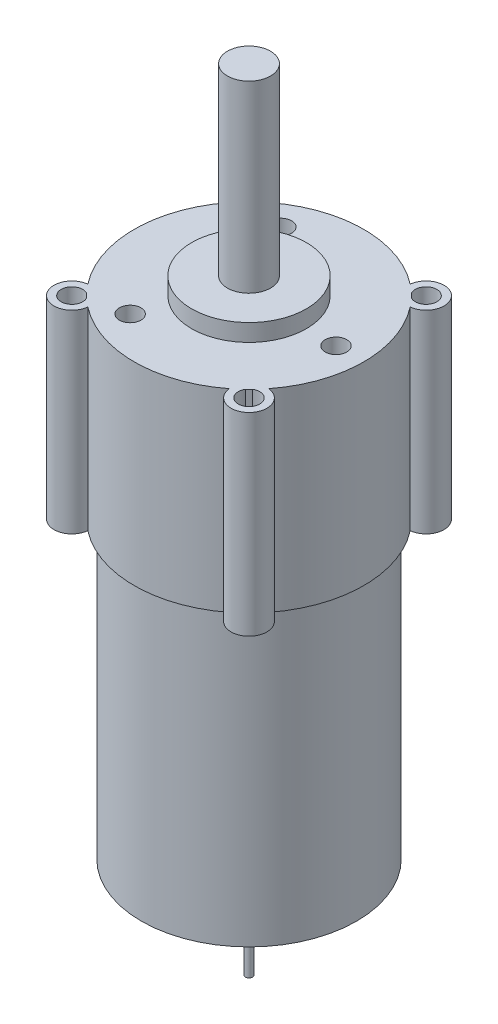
ISO-10303-21;
HEADER;
FILE_DESCRIPTION(('STEP AP214'),'2;1');
FILE_NAME('part.step','',(''),(''),'','','');
FILE_SCHEMA(('AUTOMOTIVE_DESIGN { 1 0 10303 214 1 1 1 1 }'));
ENDSEC;
DATA;
#1=APPLICATION_CONTEXT('core data for automotive mechanical design processes');
#2=APPLICATION_PROTOCOL_DEFINITION('international standard','automotive_design',2000,#1);
#3=PRODUCT_CONTEXT('',#1,'mechanical');
#4=PRODUCT('Part','Part','',(#3));
#5=PRODUCT_RELATED_PRODUCT_CATEGORY('part','',(#4));
#6=PRODUCT_DEFINITION_FORMATION('','',#4);
#7=PRODUCT_DEFINITION_CONTEXT('part definition',#1,'design');
#8=PRODUCT_DEFINITION('design','',#6,#7);
#9=PRODUCT_DEFINITION_SHAPE('','',#8);
#10=(LENGTH_UNIT() NAMED_UNIT(*) SI_UNIT(.MILLI.,.METRE.));
#11=(NAMED_UNIT(*) PLANE_ANGLE_UNIT() SI_UNIT($,.RADIAN.));
#12=(NAMED_UNIT(*) SI_UNIT($,.STERADIAN.) SOLID_ANGLE_UNIT());
#13=UNCERTAINTY_MEASURE_WITH_UNIT(LENGTH_MEASURE(1.E-05),#10,'distance_accuracy_value','');
#14=(GEOMETRIC_REPRESENTATION_CONTEXT(3) GLOBAL_UNCERTAINTY_ASSIGNED_CONTEXT((#13)) GLOBAL_UNIT_ASSIGNED_CONTEXT((#10,
#11,#12)) REPRESENTATION_CONTEXT('',''));
#15=CARTESIAN_POINT('',(0.,0.,0.));
#16=DIRECTION('',(0.,0.,1.));
#17=DIRECTION('',(1.,0.,0.));
#18=AXIS2_PLACEMENT_3D('',#15,#16,#17);
#19=CARTESIAN_POINT('',(0.,27.,0.));
#20=DIRECTION('',(0.,1.,0.));
#21=DIRECTION('',(0.,0.,1.));
#22=AXIS2_PLACEMENT_3D('',#19,#20,#21);
#23=PLANE('',#22);
#24=CARTESIAN_POINT('',(12.1243556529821,27.,0.));
#25=DIRECTION('',(0.,1.,0.));
#26=DIRECTION('',(0.,0.,1.));
#27=AXIS2_PLACEMENT_3D('',#24,#25,#26);
#28=CIRCLE('',#27,1.5);
#29=CARTESIAN_POINT('',(12.1243556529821,27.,1.5));
#30=VERTEX_POINT('',#29);
#31=EDGE_CURVE('E249',#30,#30,#28,.T.);
#32=ORIENTED_EDGE('',*,*,#31,.F.);
#33=EDGE_LOOP('',(#32));
#34=FACE_BOUND('',#33,.T.);
#35=CARTESIAN_POINT('',(-6.06217782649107,27.,-10.5));
#36=DIRECTION('',(0.,1.,0.));
#37=DIRECTION('',(0.,0.,1.));
#38=AXIS2_PLACEMENT_3D('',#35,#36,#37);
#39=CIRCLE('',#38,1.5);
#40=CARTESIAN_POINT('',(-6.06217782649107,27.,-9.));
#41=VERTEX_POINT('',#40);
#42=EDGE_CURVE('E261',#41,#41,#39,.T.);
#43=ORIENTED_EDGE('',*,*,#42,.F.);
#44=EDGE_LOOP('',(#43));
#45=FACE_BOUND('',#44,.T.);
#46=CARTESIAN_POINT('',(0.,27.,0.));
#47=DIRECTION('',(0.,1.,0.));
#48=DIRECTION('',(0.,0.,1.));
#49=AXIS2_PLACEMENT_3D('',#46,#47,#48);
#50=CIRCLE('',#49,16.);
#51=CARTESIAN_POINT('',(-12.6060378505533,27.,-9.85331465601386));
#52=VERTEX_POINT('',#51);
#53=CARTESIAN_POINT('',(-12.6060378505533,27.,9.85331465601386));
#54=VERTEX_POINT('',#53);
#55=EDGE_CURVE('E267',#52,#54,#50,.T.);
#56=ORIENTED_EDGE('',*,*,#55,.T.);
#57=CARTESIAN_POINT('',(-12.3390133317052,27.,12.3390133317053));
#58=DIRECTION('',(0.,1.,0.));
#59=DIRECTION('',(0.,0.,1.));
#60=AXIS2_PLACEMENT_3D('',#57,#58,#59);
#61=CIRCLE('',#60,2.5);
#62=CARTESIAN_POINT('',(-9.85331465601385,27.,12.6060378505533));
#63=VERTEX_POINT('',#62);
#64=EDGE_CURVE('E309',#54,#63,#61,.T.);
#65=ORIENTED_EDGE('',*,*,#64,.T.);
#66=CARTESIAN_POINT('',(9.85331465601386,27.,12.6060378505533));
#67=VERTEX_POINT('',#66);
#68=EDGE_CURVE('E56',#63,#67,#50,.T.);
#69=ORIENTED_EDGE('',*,*,#68,.T.);
#70=CARTESIAN_POINT('',(12.3390133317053,27.,12.3390133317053));
#71=DIRECTION('',(0.,1.,0.));
#72=DIRECTION('',(0.,0.,1.));
#73=AXIS2_PLACEMENT_3D('',#70,#71,#72);
#74=CIRCLE('',#73,2.5);
#75=CARTESIAN_POINT('',(12.6060378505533,27.,9.85331465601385));
#76=VERTEX_POINT('',#75);
#77=EDGE_CURVE('E175',#67,#76,#74,.T.);
#78=ORIENTED_EDGE('',*,*,#77,.T.);
#79=CARTESIAN_POINT('',(12.6060378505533,27.,-9.85331465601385));
#80=VERTEX_POINT('',#79);
#81=EDGE_CURVE('E297',#76,#80,#50,.T.);
#82=ORIENTED_EDGE('',*,*,#81,.T.);
#83=CARTESIAN_POINT('',(12.3390133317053,27.,-12.3390133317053));
#84=DIRECTION('',(0.,1.,0.));
#85=DIRECTION('',(0.,0.,1.));
#86=AXIS2_PLACEMENT_3D('',#83,#84,#85);
#87=CIRCLE('',#86,2.5);
#88=CARTESIAN_POINT('',(9.85331465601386,27.,-12.6060378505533));
#89=VERTEX_POINT('',#88);
#90=EDGE_CURVE('E202',#80,#89,#87,.T.);
#91=ORIENTED_EDGE('',*,*,#90,.T.);
#92=CARTESIAN_POINT('',(-9.85331465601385,27.,-12.6060378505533));
#93=VERTEX_POINT('',#92);
#94=EDGE_CURVE('E273',#89,#93,#50,.T.);
#95=ORIENTED_EDGE('',*,*,#94,.T.);
#96=CARTESIAN_POINT('',(-12.3390133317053,27.,-12.3390133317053));
#97=DIRECTION('',(0.,1.,0.));
#98=DIRECTION('',(0.,0.,1.));
#99=AXIS2_PLACEMENT_3D('',#96,#97,#98);
#100=CIRCLE('',#99,2.5);
#101=EDGE_CURVE('E225',#93,#52,#100,.T.);
#102=ORIENTED_EDGE('',*,*,#101,.T.);
#103=EDGE_LOOP('',(#56,#65,#69,#78,#82,#91,#95,#102));
#104=FACE_BOUND('',#103,.T.);
#105=CARTESIAN_POINT('',(-6.06217782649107,27.,10.5));
#106=DIRECTION('',(0.,1.,0.));
#107=DIRECTION('',(0.,0.,1.));
#108=AXIS2_PLACEMENT_3D('',#105,#106,#107);
#109=CIRCLE('',#108,1.5);
#110=CARTESIAN_POINT('',(-6.06217782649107,27.,12.));
#111=VERTEX_POINT('',#110);
#112=EDGE_CURVE('E255',#111,#111,#109,.T.);
#113=ORIENTED_EDGE('',*,*,#112,.F.);
#114=EDGE_LOOP('',(#113));
#115=FACE_BOUND('',#114,.T.);
#116=CARTESIAN_POINT('',(-12.3390133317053,27.,-12.3390133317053));
#117=DIRECTION('',(0.,1.,0.));
#118=DIRECTION('',(0.,0.,1.));
#119=AXIS2_PLACEMENT_3D('',#116,#117,#118);
#120=CIRCLE('',#119,1.5);
#121=CARTESIAN_POINT('',(-11.0506953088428,27.,-11.5707447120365));
#122=VERTEX_POINT('',#121);
#123=CARTESIAN_POINT('',(-11.5707447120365,27.,-11.0506953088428));
#124=VERTEX_POINT('',#123);
#125=EDGE_CURVE('E233',#122,#124,#120,.T.);
#126=ORIENTED_EDGE('',*,*,#125,.F.);
#127=EDGE_CURVE('E49',#122,#124,#50,.T.);
#128=ORIENTED_EDGE('',*,*,#127,.T.);
#129=EDGE_LOOP('',(#126,#128));
#130=FACE_BOUND('',#129,.T.);
#131=CARTESIAN_POINT('',(12.3390133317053,27.,-12.3390133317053));
#132=DIRECTION('',(0.,1.,0.));
#133=DIRECTION('',(0.,0.,1.));
#134=AXIS2_PLACEMENT_3D('',#131,#132,#133);
#135=CIRCLE('',#134,1.49999999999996);
#136=CARTESIAN_POINT('',(11.5707447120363,27.,-11.050695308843));
#137=VERTEX_POINT('',#136);
#138=CARTESIAN_POINT('',(11.050695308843,27.,-11.5707447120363));
#139=VERTEX_POINT('',#138);
#140=EDGE_CURVE('E210',#137,#139,#135,.T.);
#141=ORIENTED_EDGE('',*,*,#140,.F.);
#142=EDGE_CURVE('E294',#137,#139,#50,.T.);
#143=ORIENTED_EDGE('',*,*,#142,.T.);
#144=EDGE_LOOP('',(#141,#143));
#145=FACE_BOUND('',#144,.T.);
#146=CARTESIAN_POINT('',(12.3390133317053,27.,12.3390133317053));
#147=DIRECTION('',(0.,1.,0.));
#148=DIRECTION('',(0.,0.,1.));
#149=AXIS2_PLACEMENT_3D('',#146,#147,#148);
#150=CIRCLE('',#149,1.49999999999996);
#151=CARTESIAN_POINT('',(11.050695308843,27.,11.5707447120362));
#152=VERTEX_POINT('',#151);
#153=CARTESIAN_POINT('',(11.5707447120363,27.,11.050695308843));
#154=VERTEX_POINT('',#153);
#155=EDGE_CURVE('E179',#152,#154,#150,.T.);
#156=ORIENTED_EDGE('',*,*,#155,.F.);
#157=EDGE_CURVE('E295',#152,#154,#50,.T.);
#158=ORIENTED_EDGE('',*,*,#157,.T.);
#159=EDGE_LOOP('',(#156,#158));
#160=FACE_BOUND('',#159,.T.);
#161=CARTESIAN_POINT('',(-12.3390133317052,27.,12.3390133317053));
#162=DIRECTION('',(0.,1.,0.));
#163=DIRECTION('',(0.,0.,1.));
#164=AXIS2_PLACEMENT_3D('',#161,#162,#163);
#165=CIRCLE('',#164,1.5);
#166=CARTESIAN_POINT('',(-11.5707447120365,27.,11.0506953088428));
#167=VERTEX_POINT('',#166);
#168=CARTESIAN_POINT('',(-11.0506953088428,27.,11.5707447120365));
#169=VERTEX_POINT('',#168);
#170=EDGE_CURVE('E305',#167,#169,#165,.T.);
#171=ORIENTED_EDGE('',*,*,#170,.F.);
#172=EDGE_CURVE('E269',#167,#169,#50,.T.);
#173=ORIENTED_EDGE('',*,*,#172,.T.);
#174=EDGE_LOOP('',(#171,#173));
#175=FACE_BOUND('',#174,.T.);
#176=CARTESIAN_POINT('',(0.,27.,0.));
#177=DIRECTION('',(0.,1.,0.));
#178=DIRECTION('',(0.,0.,1.));
#179=AXIS2_PLACEMENT_3D('',#176,#177,#178);
#180=CIRCLE('',#179,8.);
#181=CARTESIAN_POINT('',(0.,27.,8.));
#182=VERTEX_POINT('',#181);
#183=EDGE_CURVE('E328',#182,#182,#180,.T.);
#184=ORIENTED_EDGE('',*,*,#183,.F.);
#185=EDGE_LOOP('',(#184));
#186=FACE_BOUND('',#185,.T.);
#187=ADVANCED_FACE('F41',(#34,#45,#104,#115,#130,#145,#160,#175,#186),#23,.T.);
#188=CARTESIAN_POINT('',(0.,-55.,0.));
#189=DIRECTION('',(0.,1.,0.));
#190=DIRECTION('',(0.,0.,1.));
#191=AXIS2_PLACEMENT_3D('',#188,#189,#190);
#192=CYLINDRICAL_SURFACE('',#191,15.);
#193=CARTESIAN_POINT('',(0.,0.,0.));
#194=DIRECTION('',(0.,1.,0.));
#195=DIRECTION('',(0.,0.,1.));
#196=AXIS2_PLACEMENT_3D('',#193,#194,#195);
#197=CIRCLE('',#196,15.);
#198=CARTESIAN_POINT('',(0.,0.,15.));
#199=VERTEX_POINT('',#198);
#200=EDGE_CURVE('E11',#199,#199,#197,.F.);
#201=ORIENTED_EDGE('',*,*,#200,.T.);
#202=EDGE_LOOP('',(#201));
#203=FACE_BOUND('',#202,.T.);
#204=CARTESIAN_POINT('',(0.,-41.,0.));
#205=DIRECTION('',(0.,-1.,0.));
#206=DIRECTION('',(0.,0.,-1.));
#207=AXIS2_PLACEMENT_3D('',#204,#205,#206);
#208=CIRCLE('',#207,15.);
#209=CARTESIAN_POINT('',(0.,-41.,-15.));
#210=VERTEX_POINT('',#209);
#211=EDGE_CURVE('E311',#210,#210,#208,.T.);
#212=ORIENTED_EDGE('',*,*,#211,.F.);
#213=EDGE_LOOP('',(#212));
#214=FACE_BOUND('',#213,.T.);
#215=ADVANCED_FACE('F357',(#203,#214),#192,.T.);
#216=CARTESIAN_POINT('',(0.,27.,0.));
#217=DIRECTION('',(0.,-1.,0.));
#218=DIRECTION('',(0.,0.,-1.));
#219=AXIS2_PLACEMENT_3D('',#216,#217,#218);
#220=CYLINDRICAL_SURFACE('',#219,16.);
#221=DIRECTION('',(0.,1.,0.));
#222=VECTOR('',#221,1.);
#223=CARTESIAN_POINT('',(-11.5707447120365,-7.05084268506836,11.0506953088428));
#224=LINE('',#223,#222);
#225=CARTESIAN_POINT('',(-11.5707447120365,0.,11.0506953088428));
#226=VERTEX_POINT('',#225);
#227=EDGE_CURVE('E182',#226,#167,#224,.T.);
#228=ORIENTED_EDGE('',*,*,#227,.F.);
#229=CARTESIAN_POINT('',(0.,0.,0.));
#230=DIRECTION('',(0.,1.,0.));
#231=DIRECTION('',(0.,0.,1.));
#232=AXIS2_PLACEMENT_3D('',#229,#230,#231);
#233=CIRCLE('',#232,16.);
#234=CARTESIAN_POINT('',(-11.0506953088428,0.,11.5707447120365));
#235=VERTEX_POINT('',#234);
#236=EDGE_CURVE('E164',#226,#235,#233,.T.);
#237=ORIENTED_EDGE('',*,*,#236,.T.);
#238=DIRECTION('',(0.,1.,0.));
#239=VECTOR('',#238,1.);
#240=CARTESIAN_POINT('',(-11.0506953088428,-7.05084268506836,11.5707447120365));
#241=LINE('',#240,#239);
#242=EDGE_CURVE('E64',#235,#169,#241,.T.);
#243=ORIENTED_EDGE('',*,*,#242,.T.);
#244=ORIENTED_EDGE('',*,*,#172,.F.);
#245=EDGE_LOOP('',(#228,#237,#243,#244));
#246=FACE_BOUND('',#245,.T.);
#247=ADVANCED_FACE('F363',(#246),#220,.T.);
#248=CARTESIAN_POINT('',(-12.6060378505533,0.,-9.85331465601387));
#249=VERTEX_POINT('',#248);
#250=CARTESIAN_POINT('',(-12.6060378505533,0.,9.85331465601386));
#251=VERTEX_POINT('',#250);
#252=EDGE_CURVE('E166',#249,#251,#233,.T.);
#253=ORIENTED_EDGE('',*,*,#252,.T.);
#254=DIRECTION('',(0.,1.,0.));
#255=VECTOR('',#254,1.);
#256=CARTESIAN_POINT('',(-12.6060378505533,-7.05084268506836,9.85331465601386));
#257=LINE('',#256,#255);
#258=EDGE_CURVE('E172',#251,#54,#257,.T.);
#259=ORIENTED_EDGE('',*,*,#258,.T.);
#260=ORIENTED_EDGE('',*,*,#55,.F.);
#261=DIRECTION('',(0.,1.,0.));
#262=VECTOR('',#261,1.);
#263=CARTESIAN_POINT('',(-12.6060378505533,-7.05084268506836,-9.85331465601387));
#264=LINE('',#263,#262);
#265=EDGE_CURVE('E241',#249,#52,#264,.T.);
#266=ORIENTED_EDGE('',*,*,#265,.F.);
#267=EDGE_LOOP('',(#253,#259,#260,#266));
#268=FACE_BOUND('',#267,.T.);
#269=ADVANCED_FACE('F408',(#268),#220,.T.);
#270=DIRECTION('',(0.,1.,0.));
#271=VECTOR('',#270,1.);
#272=CARTESIAN_POINT('',(11.050695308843,-7.05084268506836,11.5707447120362));
#273=LINE('',#272,#271);
#274=CARTESIAN_POINT('',(11.050695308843,0.,11.5707447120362));
#275=VERTEX_POINT('',#274);
#276=EDGE_CURVE('E188',#275,#152,#273,.T.);
#277=ORIENTED_EDGE('',*,*,#276,.F.);
#278=CARTESIAN_POINT('',(11.5707447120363,0.,11.050695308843));
#279=VERTEX_POINT('',#278);
#280=EDGE_CURVE('E165',#275,#279,#233,.T.);
#281=ORIENTED_EDGE('',*,*,#280,.T.);
#282=DIRECTION('',(0.,1.,0.));
#283=VECTOR('',#282,1.);
#284=CARTESIAN_POINT('',(11.5707447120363,-7.05084268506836,11.050695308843));
#285=LINE('',#284,#283);
#286=EDGE_CURVE('E195',#279,#154,#285,.T.);
#287=ORIENTED_EDGE('',*,*,#286,.T.);
#288=ORIENTED_EDGE('',*,*,#157,.F.);
#289=EDGE_LOOP('',(#277,#281,#287,#288));
#290=FACE_BOUND('',#289,.T.);
#291=ADVANCED_FACE('F405',(#290),#220,.T.);
#292=ORIENTED_EDGE('',*,*,#68,.F.);
#293=DIRECTION('',(0.,1.,0.));
#294=VECTOR('',#293,1.);
#295=CARTESIAN_POINT('',(-9.85331465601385,-7.05084268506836,12.6060378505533));
#296=LINE('',#295,#294);
#297=CARTESIAN_POINT('',(-9.85331465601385,0.,12.6060378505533));
#298=VERTEX_POINT('',#297);
#299=EDGE_CURVE('E167',#298,#63,#296,.T.);
#300=ORIENTED_EDGE('',*,*,#299,.F.);
#301=CARTESIAN_POINT('',(9.85331465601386,0.,12.6060378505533));
#302=VERTEX_POINT('',#301);
#303=EDGE_CURVE('E155',#298,#302,#233,.T.);
#304=ORIENTED_EDGE('',*,*,#303,.T.);
#305=DIRECTION('',(0.,1.,0.));
#306=VECTOR('',#305,1.);
#307=CARTESIAN_POINT('',(9.85331465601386,-7.05084268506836,12.6060378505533));
#308=LINE('',#307,#306);
#309=EDGE_CURVE('E192',#302,#67,#308,.T.);
#310=ORIENTED_EDGE('',*,*,#309,.T.);
#311=EDGE_LOOP('',(#292,#300,#304,#310));
#312=FACE_BOUND('',#311,.T.);
#313=ADVANCED_FACE('F168',(#312),#220,.T.);
#314=DIRECTION('',(0.,1.,0.));
#315=VECTOR('',#314,1.);
#316=CARTESIAN_POINT('',(11.5707447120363,-7.05084268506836,-11.050695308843));
#317=LINE('',#316,#315);
#318=CARTESIAN_POINT('',(11.5707447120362,0.,-11.050695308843));
#319=VERTEX_POINT('',#318);
#320=EDGE_CURVE('E207',#319,#137,#317,.T.);
#321=ORIENTED_EDGE('',*,*,#320,.F.);
#322=CARTESIAN_POINT('',(11.0506953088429,0.,-11.5707447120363));
#323=VERTEX_POINT('',#322);
#324=EDGE_CURVE('E274',#319,#323,#233,.T.);
#325=ORIENTED_EDGE('',*,*,#324,.T.);
#326=DIRECTION('',(0.,1.,0.));
#327=VECTOR('',#326,1.);
#328=CARTESIAN_POINT('',(11.050695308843,-7.05084268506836,-11.5707447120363));
#329=LINE('',#328,#327);
#330=EDGE_CURVE('E216',#323,#139,#329,.T.);
#331=ORIENTED_EDGE('',*,*,#330,.T.);
#332=ORIENTED_EDGE('',*,*,#142,.F.);
#333=EDGE_LOOP('',(#321,#325,#331,#332));
#334=FACE_BOUND('',#333,.T.);
#335=ADVANCED_FACE('F382',(#334),#220,.T.);
#336=ORIENTED_EDGE('',*,*,#81,.F.);
#337=DIRECTION('',(0.,1.,0.));
#338=VECTOR('',#337,1.);
#339=CARTESIAN_POINT('',(12.6060378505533,-7.05084268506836,9.85331465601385));
#340=LINE('',#339,#338);
#341=CARTESIAN_POINT('',(12.6060378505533,0.,9.85331465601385));
#342=VERTEX_POINT('',#341);
#343=EDGE_CURVE('E197',#342,#76,#340,.T.);
#344=ORIENTED_EDGE('',*,*,#343,.F.);
#345=CARTESIAN_POINT('',(12.6060378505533,0.,-9.85331465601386));
#346=VERTEX_POINT('',#345);
#347=EDGE_CURVE('E275',#342,#346,#233,.T.);
#348=ORIENTED_EDGE('',*,*,#347,.T.);
#349=DIRECTION('',(0.,1.,0.));
#350=VECTOR('',#349,1.);
#351=CARTESIAN_POINT('',(12.6060378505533,-7.05084268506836,-9.85331465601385));
#352=LINE('',#351,#350);
#353=EDGE_CURVE('E213',#346,#80,#352,.T.);
#354=ORIENTED_EDGE('',*,*,#353,.T.);
#355=EDGE_LOOP('',(#336,#344,#348,#354));
#356=FACE_BOUND('',#355,.T.);
#357=ADVANCED_FACE('F377',(#356),#220,.T.);
#358=DIRECTION('',(0.,1.,0.));
#359=VECTOR('',#358,1.);
#360=CARTESIAN_POINT('',(-11.0506953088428,-7.05084268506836,-11.5707447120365));
#361=LINE('',#360,#359);
#362=CARTESIAN_POINT('',(-11.0506953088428,0.,-11.5707447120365));
#363=VERTEX_POINT('',#362);
#364=EDGE_CURVE('E230',#363,#122,#361,.T.);
#365=ORIENTED_EDGE('',*,*,#364,.F.);
#366=CARTESIAN_POINT('',(-11.5707447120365,0.,-11.0506953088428));
#367=VERTEX_POINT('',#366);
#368=EDGE_CURVE('E270',#363,#367,#233,.T.);
#369=ORIENTED_EDGE('',*,*,#368,.T.);
#370=DIRECTION('',(0.,1.,0.));
#371=VECTOR('',#370,1.);
#372=CARTESIAN_POINT('',(-11.5707447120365,-7.05084268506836,-11.0506953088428));
#373=LINE('',#372,#371);
#374=EDGE_CURVE('E239',#367,#124,#373,.T.);
#375=ORIENTED_EDGE('',*,*,#374,.T.);
#376=ORIENTED_EDGE('',*,*,#127,.F.);
#377=EDGE_LOOP('',(#365,#369,#375,#376));
#378=FACE_BOUND('',#377,.T.);
#379=ADVANCED_FACE('F372',(#378),#220,.T.);
#380=CARTESIAN_POINT('',(0.,0.,0.));
#381=DIRECTION('',(0.,1.,0.));
#382=DIRECTION('',(0.,0.,1.));
#383=AXIS2_PLACEMENT_3D('',#380,#381,#382);
#384=PLANE('',#383);
#385=CARTESIAN_POINT('',(-12.3390133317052,0.,12.3390133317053));
#386=DIRECTION('',(0.,1.,0.));
#387=DIRECTION('',(0.,0.,1.));
#388=AXIS2_PLACEMENT_3D('',#385,#386,#387);
#389=CIRCLE('',#388,2.5);
#390=EDGE_CURVE('E159',#298,#251,#389,.F.);
#391=ORIENTED_EDGE('',*,*,#390,.T.);
#392=ORIENTED_EDGE('',*,*,#252,.F.);
#393=CARTESIAN_POINT('',(-12.3390133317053,0.,-12.3390133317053));
#394=DIRECTION('',(0.,1.,0.));
#395=DIRECTION('',(0.,0.,1.));
#396=AXIS2_PLACEMENT_3D('',#393,#394,#395);
#397=CIRCLE('',#396,2.5);
#398=CARTESIAN_POINT('',(-9.85331465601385,0.,-12.6060378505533));
#399=VERTEX_POINT('',#398);
#400=EDGE_CURVE('E229',#249,#399,#397,.F.);
#401=ORIENTED_EDGE('',*,*,#400,.T.);
#402=CARTESIAN_POINT('',(9.85331465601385,0.,-12.6060378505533));
#403=VERTEX_POINT('',#402);
#404=EDGE_CURVE('E264',#403,#399,#233,.T.);
#405=ORIENTED_EDGE('',*,*,#404,.F.);
#406=CARTESIAN_POINT('',(12.3390133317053,0.,-12.3390133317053));
#407=DIRECTION('',(0.,1.,0.));
#408=DIRECTION('',(0.,0.,1.));
#409=AXIS2_PLACEMENT_3D('',#406,#407,#408);
#410=CIRCLE('',#409,2.5);
#411=EDGE_CURVE('E206',#403,#346,#410,.F.);
#412=ORIENTED_EDGE('',*,*,#411,.T.);
#413=ORIENTED_EDGE('',*,*,#347,.F.);
#414=CARTESIAN_POINT('',(12.3390133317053,0.,12.3390133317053));
#415=DIRECTION('',(0.,1.,0.));
#416=DIRECTION('',(0.,0.,1.));
#417=AXIS2_PLACEMENT_3D('',#414,#415,#416);
#418=CIRCLE('',#417,2.5);
#419=EDGE_CURVE('E162',#342,#302,#418,.F.);
#420=ORIENTED_EDGE('',*,*,#419,.T.);
#421=ORIENTED_EDGE('',*,*,#303,.F.);
#422=EDGE_LOOP('',(#391,#392,#401,#405,#412,#413,#420,#421));
#423=FACE_BOUND('',#422,.T.);
#424=ORIENTED_EDGE('',*,*,#236,.F.);
#425=CARTESIAN_POINT('',(-12.3390133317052,0.,12.3390133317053));
#426=DIRECTION('',(0.,1.,0.));
#427=DIRECTION('',(0.,0.,1.));
#428=AXIS2_PLACEMENT_3D('',#425,#426,#427);
#429=CIRCLE('',#428,1.5);
#430=EDGE_CURVE('E176',#235,#226,#429,.F.);
#431=ORIENTED_EDGE('',*,*,#430,.F.);
#432=EDGE_LOOP('',(#424,#431));
#433=FACE_BOUND('',#432,.T.);
#434=ORIENTED_EDGE('',*,*,#280,.F.);
#435=CARTESIAN_POINT('',(12.3390133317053,0.,12.3390133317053));
#436=DIRECTION('',(0.,1.,0.));
#437=DIRECTION('',(0.,0.,1.));
#438=AXIS2_PLACEMENT_3D('',#435,#436,#437);
#439=CIRCLE('',#438,1.49999999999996);
#440=EDGE_CURVE('E186',#279,#275,#439,.F.);
#441=ORIENTED_EDGE('',*,*,#440,.F.);
#442=EDGE_LOOP('',(#434,#441));
#443=FACE_BOUND('',#442,.T.);
#444=ORIENTED_EDGE('',*,*,#368,.F.);
#445=CARTESIAN_POINT('',(-12.3390133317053,0.,-12.3390133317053));
#446=DIRECTION('',(0.,1.,0.));
#447=DIRECTION('',(0.,0.,1.));
#448=AXIS2_PLACEMENT_3D('',#445,#446,#447);
#449=CIRCLE('',#448,1.5);
#450=EDGE_CURVE('E226',#367,#363,#449,.F.);
#451=ORIENTED_EDGE('',*,*,#450,.F.);
#452=EDGE_LOOP('',(#444,#451));
#453=FACE_BOUND('',#452,.T.);
#454=ORIENTED_EDGE('',*,*,#200,.F.);
#455=EDGE_LOOP('',(#454));
#456=FACE_BOUND('',#455,.T.);
#457=ORIENTED_EDGE('',*,*,#324,.F.);
#458=CARTESIAN_POINT('',(12.3390133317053,0.,-12.3390133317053));
#459=DIRECTION('',(0.,1.,0.));
#460=DIRECTION('',(0.,0.,1.));
#461=AXIS2_PLACEMENT_3D('',#458,#459,#460);
#462=CIRCLE('',#461,1.49999999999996);
#463=EDGE_CURVE('E203',#323,#319,#462,.F.);
#464=ORIENTED_EDGE('',*,*,#463,.F.);
#465=EDGE_LOOP('',(#457,#464));
#466=FACE_BOUND('',#465,.T.);
#467=ADVANCED_FACE('F156',(#423,#433,#443,#453,#456,#466),#384,.F.);
#468=ORIENTED_EDGE('',*,*,#94,.F.);
#469=DIRECTION('',(0.,1.,0.));
#470=VECTOR('',#469,1.);
#471=CARTESIAN_POINT('',(9.85331465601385,-7.05084268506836,-12.6060378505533));
#472=LINE('',#471,#470);
#473=EDGE_CURVE('E218',#403,#89,#472,.T.);
#474=ORIENTED_EDGE('',*,*,#473,.F.);
#475=ORIENTED_EDGE('',*,*,#404,.T.);
#476=DIRECTION('',(0.,1.,0.));
#477=VECTOR('',#476,1.);
#478=CARTESIAN_POINT('',(-9.85331465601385,-7.05084268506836,-12.6060378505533));
#479=LINE('',#478,#477);
#480=EDGE_CURVE('E236',#399,#93,#479,.T.);
#481=ORIENTED_EDGE('',*,*,#480,.T.);
#482=EDGE_LOOP('',(#468,#474,#475,#481));
#483=FACE_BOUND('',#482,.T.);
#484=ADVANCED_FACE('F43',(#483),#220,.T.);
#485=CARTESIAN_POINT('',(-6.06217782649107,27.,-10.5));
#486=DIRECTION('',(0.,-1.,0.));
#487=DIRECTION('',(0.,0.,-1.));
#488=AXIS2_PLACEMENT_3D('',#485,#486,#487);
#489=CYLINDRICAL_SURFACE('',#488,1.5);
#490=ORIENTED_EDGE('',*,*,#42,.T.);
#491=EDGE_LOOP('',(#490));
#492=FACE_BOUND('',#491,.T.);
#493=CARTESIAN_POINT('',(-6.06217782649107,0.,-10.5));
#494=DIRECTION('',(0.,1.,0.));
#495=DIRECTION('',(0.,0.,1.));
#496=AXIS2_PLACEMENT_3D('',#493,#494,#495);
#497=CIRCLE('',#496,1.5);
#498=CARTESIAN_POINT('',(-6.06217782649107,0.,-9.));
#499=VERTEX_POINT('',#498);
#500=EDGE_CURVE('E258',#499,#499,#497,.T.);
#501=ORIENTED_EDGE('',*,*,#500,.F.);
#502=EDGE_LOOP('',(#501));
#503=FACE_BOUND('',#502,.T.);
#504=ADVANCED_FACE('F369',(#492,#503),#489,.F.);
#505=CARTESIAN_POINT('',(-6.06217782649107,27.,10.5));
#506=DIRECTION('',(0.,-1.,0.));
#507=DIRECTION('',(0.,0.,-1.));
#508=AXIS2_PLACEMENT_3D('',#505,#506,#507);
#509=CYLINDRICAL_SURFACE('',#508,1.5);
#510=ORIENTED_EDGE('',*,*,#112,.T.);
#511=EDGE_LOOP('',(#510));
#512=FACE_BOUND('',#511,.T.);
#513=CARTESIAN_POINT('',(-6.06217782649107,0.,10.5));
#514=DIRECTION('',(0.,1.,0.));
#515=DIRECTION('',(0.,0.,1.));
#516=AXIS2_PLACEMENT_3D('',#513,#514,#515);
#517=CIRCLE('',#516,1.5);
#518=CARTESIAN_POINT('',(-6.06217782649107,0.,12.));
#519=VERTEX_POINT('',#518);
#520=EDGE_CURVE('E252',#519,#519,#517,.T.);
#521=ORIENTED_EDGE('',*,*,#520,.F.);
#522=EDGE_LOOP('',(#521));
#523=FACE_BOUND('',#522,.T.);
#524=ADVANCED_FACE('F528',(#512,#523),#509,.F.);
#525=CARTESIAN_POINT('',(12.1243556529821,27.,0.));
#526=DIRECTION('',(0.,-1.,0.));
#527=DIRECTION('',(0.,0.,-1.));
#528=AXIS2_PLACEMENT_3D('',#525,#526,#527);
#529=CYLINDRICAL_SURFACE('',#528,1.5);
#530=ORIENTED_EDGE('',*,*,#31,.T.);
#531=EDGE_LOOP('',(#530));
#532=FACE_BOUND('',#531,.T.);
#533=CARTESIAN_POINT('',(12.1243556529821,0.,0.));
#534=DIRECTION('',(0.,1.,0.));
#535=DIRECTION('',(0.,0.,1.));
#536=AXIS2_PLACEMENT_3D('',#533,#534,#535);
#537=CIRCLE('',#536,1.5);
#538=CARTESIAN_POINT('',(12.1243556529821,0.,1.5));
#539=VERTEX_POINT('',#538);
#540=EDGE_CURVE('E248',#539,#539,#537,.T.);
#541=ORIENTED_EDGE('',*,*,#540,.F.);
#542=EDGE_LOOP('',(#541));
#543=FACE_BOUND('',#542,.T.);
#544=ADVANCED_FACE('F526',(#532,#543),#529,.F.);
#545=CARTESIAN_POINT('',(0.,0.,0.));
#546=DIRECTION('',(0.,-1.,0.));
#547=DIRECTION('',(0.,0.,-1.));
#548=AXIS2_PLACEMENT_3D('',#545,#546,#547);
#549=PLANE('',#548);
#550=ORIENTED_EDGE('',*,*,#540,.T.);
#551=EDGE_LOOP('',(#550));
#552=FACE_BOUND('',#551,.T.);
#553=ADVANCED_FACE('F524',(#552),#549,.F.);
#554=ORIENTED_EDGE('',*,*,#520,.T.);
#555=EDGE_LOOP('',(#554));
#556=FACE_BOUND('',#555,.T.);
#557=ADVANCED_FACE('F522',(#556),#549,.F.);
#558=ORIENTED_EDGE('',*,*,#500,.T.);
#559=EDGE_LOOP('',(#558));
#560=FACE_BOUND('',#559,.T.);
#561=ADVANCED_FACE('F518',(#560),#549,.F.);
#562=CARTESIAN_POINT('',(-12.3390133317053,-7.05084268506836,-12.3390133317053));
#563=DIRECTION('',(0.,1.,0.));
#564=DIRECTION('',(0.,0.,1.));
#565=AXIS2_PLACEMENT_3D('',#562,#563,#564);
#566=CYLINDRICAL_SURFACE('',#565,1.5);
#567=ORIENTED_EDGE('',*,*,#374,.F.);
#568=ORIENTED_EDGE('',*,*,#450,.T.);
#569=ORIENTED_EDGE('',*,*,#364,.T.);
#570=ORIENTED_EDGE('',*,*,#125,.T.);
#571=EDGE_LOOP('',(#567,#568,#569,#570));
#572=FACE_BOUND('',#571,.T.);
#573=ADVANCED_FACE('F389',(#572),#566,.F.);
#574=CARTESIAN_POINT('',(-12.3390133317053,-7.05084268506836,-12.3390133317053));
#575=DIRECTION('',(0.,1.,0.));
#576=DIRECTION('',(0.,0.,1.));
#577=AXIS2_PLACEMENT_3D('',#574,#575,#576);
#578=CYLINDRICAL_SURFACE('',#577,2.5);
#579=ORIENTED_EDGE('',*,*,#400,.F.);
#580=ORIENTED_EDGE('',*,*,#265,.T.);
#581=ORIENTED_EDGE('',*,*,#101,.F.);
#582=ORIENTED_EDGE('',*,*,#480,.F.);
#583=EDGE_LOOP('',(#579,#580,#581,#582));
#584=FACE_BOUND('',#583,.T.);
#585=ADVANCED_FACE('F290',(#584),#578,.T.);
#586=CARTESIAN_POINT('',(12.3390133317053,-7.05084268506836,-12.3390133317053));
#587=DIRECTION('',(0.,1.,0.));
#588=DIRECTION('',(0.,0.,1.));
#589=AXIS2_PLACEMENT_3D('',#586,#587,#588);
#590=CYLINDRICAL_SURFACE('',#589,1.49999999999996);
#591=ORIENTED_EDGE('',*,*,#330,.F.);
#592=ORIENTED_EDGE('',*,*,#463,.T.);
#593=ORIENTED_EDGE('',*,*,#320,.T.);
#594=ORIENTED_EDGE('',*,*,#140,.T.);
#595=EDGE_LOOP('',(#591,#592,#593,#594));
#596=FACE_BOUND('',#595,.T.);
#597=ADVANCED_FACE('F397',(#596),#590,.F.);
#598=CARTESIAN_POINT('',(12.3390133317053,-7.05084268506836,-12.3390133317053));
#599=DIRECTION('',(0.,1.,0.));
#600=DIRECTION('',(0.,0.,1.));
#601=AXIS2_PLACEMENT_3D('',#598,#599,#600);
#602=CYLINDRICAL_SURFACE('',#601,2.5);
#603=ORIENTED_EDGE('',*,*,#411,.F.);
#604=ORIENTED_EDGE('',*,*,#473,.T.);
#605=ORIENTED_EDGE('',*,*,#90,.F.);
#606=ORIENTED_EDGE('',*,*,#353,.F.);
#607=EDGE_LOOP('',(#603,#604,#605,#606));
#608=FACE_BOUND('',#607,.T.);
#609=ADVANCED_FACE('F507',(#608),#602,.T.);
#610=CARTESIAN_POINT('',(12.3390133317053,-7.05084268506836,12.3390133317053));
#611=DIRECTION('',(0.,1.,0.));
#612=DIRECTION('',(0.,0.,1.));
#613=AXIS2_PLACEMENT_3D('',#610,#611,#612);
#614=CYLINDRICAL_SURFACE('',#613,1.49999999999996);
#615=ORIENTED_EDGE('',*,*,#286,.F.);
#616=ORIENTED_EDGE('',*,*,#440,.T.);
#617=ORIENTED_EDGE('',*,*,#276,.T.);
#618=ORIENTED_EDGE('',*,*,#155,.T.);
#619=EDGE_LOOP('',(#615,#616,#617,#618));
#620=FACE_BOUND('',#619,.T.);
#621=ADVANCED_FACE('F401',(#620),#614,.F.);
#622=CARTESIAN_POINT('',(12.3390133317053,-7.05084268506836,12.3390133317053));
#623=DIRECTION('',(0.,1.,0.));
#624=DIRECTION('',(0.,0.,1.));
#625=AXIS2_PLACEMENT_3D('',#622,#623,#624);
#626=CYLINDRICAL_SURFACE('',#625,2.5);
#627=ORIENTED_EDGE('',*,*,#419,.F.);
#628=ORIENTED_EDGE('',*,*,#343,.T.);
#629=ORIENTED_EDGE('',*,*,#77,.F.);
#630=ORIENTED_EDGE('',*,*,#309,.F.);
#631=EDGE_LOOP('',(#627,#628,#629,#630));
#632=FACE_BOUND('',#631,.T.);
#633=ADVANCED_FACE('F503',(#632),#626,.T.);
#634=CARTESIAN_POINT('',(-12.3390133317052,-7.05084268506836,12.3390133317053));
#635=DIRECTION('',(0.,1.,0.));
#636=DIRECTION('',(0.,0.,1.));
#637=AXIS2_PLACEMENT_3D('',#634,#635,#636);
#638=CYLINDRICAL_SURFACE('',#637,1.5);
#639=ORIENTED_EDGE('',*,*,#242,.F.);
#640=ORIENTED_EDGE('',*,*,#430,.T.);
#641=ORIENTED_EDGE('',*,*,#227,.T.);
#642=ORIENTED_EDGE('',*,*,#170,.T.);
#643=EDGE_LOOP('',(#639,#640,#641,#642));
#644=FACE_BOUND('',#643,.T.);
#645=ADVANCED_FACE('F308',(#644),#638,.F.);
#646=CARTESIAN_POINT('',(-12.3390133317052,-7.05084268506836,12.3390133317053));
#647=DIRECTION('',(0.,1.,0.));
#648=DIRECTION('',(0.,0.,1.));
#649=AXIS2_PLACEMENT_3D('',#646,#647,#648);
#650=CYLINDRICAL_SURFACE('',#649,2.5);
#651=ORIENTED_EDGE('',*,*,#390,.F.);
#652=ORIENTED_EDGE('',*,*,#299,.T.);
#653=ORIENTED_EDGE('',*,*,#64,.F.);
#654=ORIENTED_EDGE('',*,*,#258,.F.);
#655=EDGE_LOOP('',(#651,#652,#653,#654));
#656=FACE_BOUND('',#655,.T.);
#657=ADVANCED_FACE('F174',(#656),#650,.T.);
#658=CARTESIAN_POINT('',(0.,-41.,0.));
#659=DIRECTION('',(0.,-1.,0.));
#660=DIRECTION('',(0.,0.,-1.));
#661=AXIS2_PLACEMENT_3D('',#658,#659,#660);
#662=PLANE('',#661);
#663=CARTESIAN_POINT('',(0.,-41.,0.));
#664=DIRECTION('',(0.,-1.,0.));
#665=DIRECTION('',(0.,0.,-1.));
#666=AXIS2_PLACEMENT_3D('',#663,#664,#665);
#667=CIRCLE('',#666,0.5);
#668=CARTESIAN_POINT('',(0.,-41.,-0.5));
#669=VERTEX_POINT('',#668);
#670=EDGE_CURVE('E318',#669,#669,#667,.T.);
#671=ORIENTED_EDGE('',*,*,#670,.F.);
#672=EDGE_LOOP('',(#671));
#673=FACE_BOUND('',#672,.T.);
#674=ORIENTED_EDGE('',*,*,#211,.T.);
#675=EDGE_LOOP('',(#674));
#676=FACE_BOUND('',#675,.T.);
#677=ADVANCED_FACE('F435',(#673,#676),#662,.T.);
#678=CARTESIAN_POINT('',(0.,-41.,0.));
#679=DIRECTION('',(0.,-1.,0.));
#680=DIRECTION('',(0.,0.,-1.));
#681=AXIS2_PLACEMENT_3D('',#678,#679,#680);
#682=CYLINDRICAL_SURFACE('',#681,0.5);
#683=ORIENTED_EDGE('',*,*,#670,.T.);
#684=EDGE_LOOP('',(#683));
#685=FACE_BOUND('',#684,.T.);
#686=CARTESIAN_POINT('',(0.,-55.,0.));
#687=DIRECTION('',(0.,-1.,0.));
#688=DIRECTION('',(0.,0.,-1.));
#689=AXIS2_PLACEMENT_3D('',#686,#687,#688);
#690=CIRCLE('',#689,0.5);
#691=CARTESIAN_POINT('',(0.,-55.,-0.5));
#692=VERTEX_POINT('',#691);
#693=EDGE_CURVE('E319',#692,#692,#690,.T.);
#694=ORIENTED_EDGE('',*,*,#693,.F.);
#695=EDGE_LOOP('',(#694));
#696=FACE_BOUND('',#695,.T.);
#697=ADVANCED_FACE('F353',(#685,#696),#682,.T.);
#698=CARTESIAN_POINT('',(0.,-55.,0.));
#699=DIRECTION('',(0.,-1.,0.));
#700=DIRECTION('',(0.,0.,-1.));
#701=AXIS2_PLACEMENT_3D('',#698,#699,#700);
#702=PLANE('',#701);
#703=ORIENTED_EDGE('',*,*,#693,.T.);
#704=EDGE_LOOP('',(#703));
#705=FACE_BOUND('',#704,.T.);
#706=ADVANCED_FACE('F343',(#705),#702,.T.);
#707=CARTESIAN_POINT('',(0.,29.4,0.));
#708=DIRECTION('',(0.,1.,0.));
#709=DIRECTION('',(0.,0.,1.));
#710=AXIS2_PLACEMENT_3D('',#707,#708,#709);
#711=PLANE('',#710);
#712=CARTESIAN_POINT('',(0.,29.4,0.));
#713=DIRECTION('',(0.,1.,0.));
#714=DIRECTION('',(0.,0.,1.));
#715=AXIS2_PLACEMENT_3D('',#712,#713,#714);
#716=CIRCLE('',#715,8.);
#717=CARTESIAN_POINT('',(0.,29.4,8.));
#718=VERTEX_POINT('',#717);
#719=EDGE_CURVE('E327',#718,#718,#716,.T.);
#720=ORIENTED_EDGE('',*,*,#719,.T.);
#721=EDGE_LOOP('',(#720));
#722=FACE_BOUND('',#721,.T.);
#723=CARTESIAN_POINT('',(0.,29.4,0.));
#724=DIRECTION('',(0.,1.,0.));
#725=DIRECTION('',(0.,0.,1.));
#726=AXIS2_PLACEMENT_3D('',#723,#724,#725);
#727=CIRCLE('',#726,3.);
#728=CARTESIAN_POINT('',(0.,29.4,3.));
#729=VERTEX_POINT('',#728);
#730=EDGE_CURVE('E331',#729,#729,#727,.T.);
#731=ORIENTED_EDGE('',*,*,#730,.F.);
#732=EDGE_LOOP('',(#731));
#733=FACE_BOUND('',#732,.T.);
#734=ADVANCED_FACE('F340',(#722,#733),#711,.T.);
#735=CARTESIAN_POINT('',(0.,29.4,0.));
#736=DIRECTION('',(0.,-1.,0.));
#737=DIRECTION('',(0.,0.,-1.));
#738=AXIS2_PLACEMENT_3D('',#735,#736,#737);
#739=CYLINDRICAL_SURFACE('',#738,8.);
#740=ORIENTED_EDGE('',*,*,#719,.F.);
#741=EDGE_LOOP('',(#740));
#742=FACE_BOUND('',#741,.T.);
#743=ORIENTED_EDGE('',*,*,#183,.T.);
#744=EDGE_LOOP('',(#743));
#745=FACE_BOUND('',#744,.T.);
#746=ADVANCED_FACE('F342',(#742,#745),#739,.T.);
#747=CARTESIAN_POINT('',(0.,55.,0.));
#748=DIRECTION('',(0.,1.,0.));
#749=DIRECTION('',(0.,0.,1.));
#750=AXIS2_PLACEMENT_3D('',#747,#748,#749);
#751=PLANE('',#750);
#752=CARTESIAN_POINT('',(0.,55.,0.));
#753=DIRECTION('',(0.,1.,0.));
#754=DIRECTION('',(0.,0.,1.));
#755=AXIS2_PLACEMENT_3D('',#752,#753,#754);
#756=CIRCLE('',#755,3.);
#757=CARTESIAN_POINT('',(0.,55.,3.));
#758=VERTEX_POINT('',#757);
#759=EDGE_CURVE('E322',#758,#758,#756,.T.);
#760=ORIENTED_EDGE('',*,*,#759,.T.);
#761=EDGE_LOOP('',(#760));
#762=FACE_BOUND('',#761,.T.);
#763=ADVANCED_FACE('F350',(#762),#751,.T.);
#764=CARTESIAN_POINT('',(0.,55.,0.));
#765=DIRECTION('',(0.,-1.,0.));
#766=DIRECTION('',(0.,0.,-1.));
#767=AXIS2_PLACEMENT_3D('',#764,#765,#766);
#768=CYLINDRICAL_SURFACE('',#767,3.);
#769=ORIENTED_EDGE('',*,*,#730,.T.);
#770=EDGE_LOOP('',(#769));
#771=FACE_BOUND('',#770,.T.);
#772=ORIENTED_EDGE('',*,*,#759,.F.);
#773=EDGE_LOOP('',(#772));
#774=FACE_BOUND('',#773,.T.);
#775=ADVANCED_FACE('F337',(#771,#774),#768,.T.);
#776=CLOSED_SHELL('',(#187,#215,#247,#269,#291,#313,#335,#357,#379,#467,#484,#504,#524,#544,
#553,#557,#561,#573,#585,#597,#609,#621,#633,#645,#657,#677,#697,#706,#734,#746,#763,#775));
#777=MANIFOLD_SOLID_BREP('B2',#776);
#778=ADVANCED_BREP_SHAPE_REPRESENTATION('',(#18,#777),#14);
#779=SHAPE_DEFINITION_REPRESENTATION(#9,#778);
ENDSEC;
END-ISO-10303-21;
